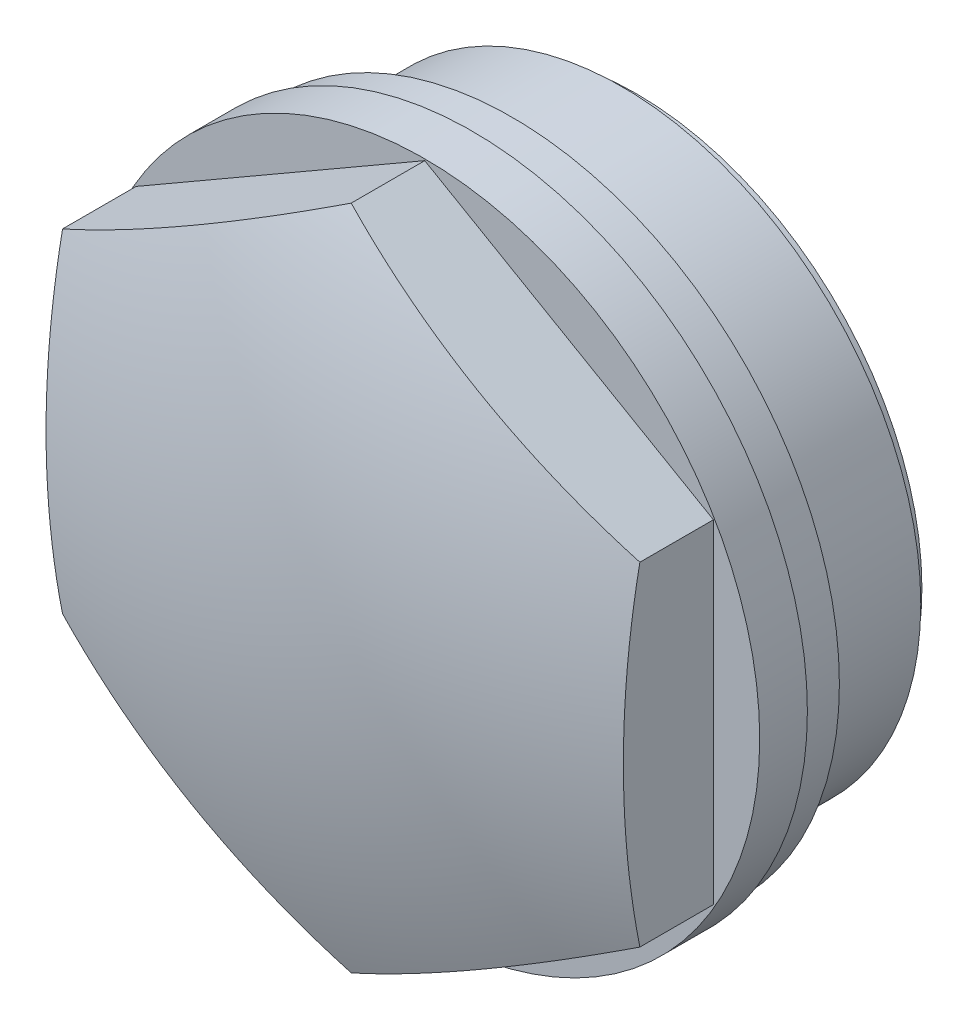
ISO-10303-21;
HEADER;
FILE_DESCRIPTION(('STEP AP214'),'2;1');
FILE_NAME('part.step','',(''),(''),'','','');
FILE_SCHEMA(('AUTOMOTIVE_DESIGN { 1 0 10303 214 1 1 1 1 }'));
ENDSEC;
DATA;
#1=APPLICATION_CONTEXT('core data for automotive mechanical design processes');
#2=APPLICATION_PROTOCOL_DEFINITION('international standard','automotive_design',2000,#1);
#3=PRODUCT_CONTEXT('',#1,'mechanical');
#4=PRODUCT('Part','Part','',(#3));
#5=PRODUCT_RELATED_PRODUCT_CATEGORY('part','',(#4));
#6=PRODUCT_DEFINITION_FORMATION('','',#4);
#7=PRODUCT_DEFINITION_CONTEXT('part definition',#1,'design');
#8=PRODUCT_DEFINITION('design','',#6,#7);
#9=PRODUCT_DEFINITION_SHAPE('','',#8);
#10=(LENGTH_UNIT() NAMED_UNIT(*) SI_UNIT(.MILLI.,.METRE.));
#11=(NAMED_UNIT(*) PLANE_ANGLE_UNIT() SI_UNIT($,.RADIAN.));
#12=(NAMED_UNIT(*) SI_UNIT($,.STERADIAN.) SOLID_ANGLE_UNIT());
#13=UNCERTAINTY_MEASURE_WITH_UNIT(LENGTH_MEASURE(1.E-05),#10,'distance_accuracy_value','');
#14=(GEOMETRIC_REPRESENTATION_CONTEXT(3) GLOBAL_UNCERTAINTY_ASSIGNED_CONTEXT((#13)) GLOBAL_UNIT_ASSIGNED_CONTEXT((#10,
#11,#12)) REPRESENTATION_CONTEXT('',''));
#15=CARTESIAN_POINT('',(0.,0.,0.));
#16=DIRECTION('',(0.,0.,1.));
#17=DIRECTION('',(1.,0.,0.));
#18=AXIS2_PLACEMENT_3D('',#15,#16,#17);
#19=CARTESIAN_POINT('',(0.,0.,15.786));
#20=DIRECTION('',(0.,0.,1.));
#21=DIRECTION('',(1.,0.,0.));
#22=AXIS2_PLACEMENT_3D('',#19,#20,#21);
#23=CYLINDRICAL_SURFACE('',#22,23.5);
#24=CARTESIAN_POINT('',(0.,0.,6.12962139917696));
#25=DIRECTION('',(0.,0.,1.));
#26=DIRECTION('',(1.,0.,0.));
#27=AXIS2_PLACEMENT_3D('',#24,#25,#26);
#28=CIRCLE('',#27,23.5);
#29=CARTESIAN_POINT('',(23.4999999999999,0.,6.12962139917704));
#30=VERTEX_POINT('',#29);
#31=EDGE_CURVE('E141',#30,#30,#28,.T.);
#32=ORIENTED_EDGE('',*,*,#31,.F.);
#33=EDGE_LOOP('',(#32));
#34=FACE_BOUND('',#33,.T.);
#35=CARTESIAN_POINT('',(0.,0.,2.786));
#36=DIRECTION('',(0.,0.,1.));
#37=DIRECTION('',(1.,0.,0.));
#38=AXIS2_PLACEMENT_3D('',#35,#36,#37);
#39=CIRCLE('',#38,23.5);
#40=CARTESIAN_POINT('',(23.5,0.,2.78600000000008));
#41=VERTEX_POINT('',#40);
#42=EDGE_CURVE('E109',#41,#41,#39,.T.);
#43=ORIENTED_EDGE('',*,*,#42,.T.);
#44=EDGE_LOOP('',(#43));
#45=FACE_BOUND('',#44,.T.);
#46=ADVANCED_FACE('F14',(#34,#45),#23,.T.);
#47=CARTESIAN_POINT('',(1.45863615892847E-13,0.,-50.4909999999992));
#48=DIRECTION('',(0.,0.,1.));
#49=DIRECTION('',(0.,-1.,0.));
#50=AXIS2_PLACEMENT_3D('',#47,#48,#49);
#51=SPHERICAL_SURFACE('',#50,63.0269999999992);
#52=CARTESIAN_POINT('',(0.,0.,10.6500879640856));
#53=DIRECTION('',(0.,0.,1.));
#54=DIRECTION('',(1.,0.,0.));
#55=AXIS2_PLACEMENT_3D('',#52,#53,#54);
#56=CIRCLE('',#55,15.3026171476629);
#57=CARTESIAN_POINT('',(15.3026171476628,0.,10.6500879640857));
#58=VERTEX_POINT('',#57);
#59=EDGE_CURVE('E133',#58,#58,#56,.T.);
#60=ORIENTED_EDGE('',*,*,#59,.F.);
#61=EDGE_LOOP('',(#60));
#62=FACE_BOUND('',#61,.T.);
#63=ADVANCED_FACE('F16',(#62),#51,.F.);
#64=CARTESIAN_POINT('',(0.,0.,10.6500879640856));
#65=DIRECTION('',(0.,0.,-1.));
#66=DIRECTION('',(-1.,0.,0.));
#67=AXIS2_PLACEMENT_3D('',#64,#65,#66);
#68=CONICAL_SURFACE('',#67,15.3026171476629,0.034906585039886);
#69=CARTESIAN_POINT('',(0.,0.,-8.714));
#70=DIRECTION('',(0.,0.,1.));
#71=DIRECTION('',(1.,0.,0.));
#72=AXIS2_PLACEMENT_3D('',#69,#70,#71);
#73=CIRCLE('',#72,15.9788259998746);
#74=CARTESIAN_POINT('',(15.9788259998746,0.,-8.71399999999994));
#75=VERTEX_POINT('',#74);
#76=EDGE_CURVE('E130',#75,#75,#73,.T.);
#77=ORIENTED_EDGE('',*,*,#76,.F.);
#78=EDGE_LOOP('',(#77));
#79=FACE_BOUND('',#78,.T.);
#80=ORIENTED_EDGE('',*,*,#59,.T.);
#81=EDGE_LOOP('',(#80));
#82=FACE_BOUND('',#81,.T.);
#83=ADVANCED_FACE('F172',(#79,#82),#68,.F.);
#84=CARTESIAN_POINT('',(0.,15.9788259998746,-8.714));
#85=DIRECTION('',(0.,0.,1.));
#86=DIRECTION('',(1.,0.,0.));
#87=AXIS2_PLACEMENT_3D('',#84,#85,#86);
#88=PLANE('',#87);
#89=CARTESIAN_POINT('',(0.,0.,-8.714));
#90=DIRECTION('',(0.,0.,1.));
#91=DIRECTION('',(1.,0.,0.));
#92=AXIS2_PLACEMENT_3D('',#89,#90,#91);
#93=CIRCLE('',#92,20.0348475);
#94=CARTESIAN_POINT('',(20.0348475,0.,-8.71399999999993));
#95=VERTEX_POINT('',#94);
#96=EDGE_CURVE('E127',#95,#95,#93,.T.);
#97=ORIENTED_EDGE('',*,*,#96,.F.);
#98=EDGE_LOOP('',(#97));
#99=FACE_BOUND('',#98,.T.);
#100=ORIENTED_EDGE('',*,*,#76,.T.);
#101=EDGE_LOOP('',(#100));
#102=FACE_BOUND('',#101,.T.);
#103=ADVANCED_FACE('F202',(#99,#102),#88,.F.);
#104=CARTESIAN_POINT('',(0.,0.,15.786));
#105=DIRECTION('',(0.,0.,1.));
#106=DIRECTION('',(1.,0.,0.));
#107=AXIS2_PLACEMENT_3D('',#104,#105,#106);
#108=CYLINDRICAL_SURFACE('',#107,20.0348475);
#109=CARTESIAN_POINT('',(0.,0.,-7.714));
#110=DIRECTION('',(0.,0.,1.));
#111=DIRECTION('',(1.,0.,0.));
#112=AXIS2_PLACEMENT_3D('',#109,#110,#111);
#113=CIRCLE('',#112,20.0348475);
#114=CARTESIAN_POINT('',(20.0348475,0.,-7.71399999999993));
#115=VERTEX_POINT('',#114);
#116=EDGE_CURVE('E124',#115,#115,#113,.T.);
#117=ORIENTED_EDGE('',*,*,#116,.F.);
#118=EDGE_LOOP('',(#117));
#119=FACE_BOUND('',#118,.T.);
#120=ORIENTED_EDGE('',*,*,#96,.T.);
#121=EDGE_LOOP('',(#120));
#122=FACE_BOUND('',#121,.T.);
#123=ADVANCED_FACE('F198',(#119,#122),#108,.T.);
#124=CARTESIAN_POINT('',(0.,20.0348475,-7.714));
#125=DIRECTION('',(0.,0.,1.));
#126=DIRECTION('',(1.,0.,0.));
#127=AXIS2_PLACEMENT_3D('',#124,#125,#126);
#128=PLANE('',#127);
#129=CARTESIAN_POINT('',(0.,0.,-7.714));
#130=DIRECTION('',(0.,0.,1.));
#131=DIRECTION('',(1.,0.,0.));
#132=AXIS2_PLACEMENT_3D('',#129,#130,#131);
#133=CIRCLE('',#132,20.955);
#134=CARTESIAN_POINT('',(20.955,0.,-7.71399999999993));
#135=VERTEX_POINT('',#134);
#136=EDGE_CURVE('E121',#135,#135,#133,.T.);
#137=ORIENTED_EDGE('',*,*,#136,.F.);
#138=EDGE_LOOP('',(#137));
#139=FACE_BOUND('',#138,.T.);
#140=ORIENTED_EDGE('',*,*,#116,.T.);
#141=EDGE_LOOP('',(#140));
#142=FACE_BOUND('',#141,.T.);
#143=ADVANCED_FACE('F194',(#139,#142),#128,.F.);
#144=CARTESIAN_POINT('',(0.,0.,15.786));
#145=DIRECTION('',(0.,0.,1.));
#146=DIRECTION('',(1.,0.,0.));
#147=AXIS2_PLACEMENT_3D('',#144,#145,#146);
#148=CYLINDRICAL_SURFACE('',#147,20.955);
#149=CARTESIAN_POINT('',(0.,0.,-0.000112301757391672));
#150=DIRECTION('',(0.,0.,1.));
#151=DIRECTION('',(1.,0.,0.));
#152=AXIS2_PLACEMENT_3D('',#149,#150,#151);
#153=CIRCLE('',#152,20.955);
#154=CARTESIAN_POINT('',(20.955,0.,-0.000112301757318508));
#155=VERTEX_POINT('',#154);
#156=EDGE_CURVE('E118',#155,#155,#153,.T.);
#157=ORIENTED_EDGE('',*,*,#156,.F.);
#158=EDGE_LOOP('',(#157));
#159=FACE_BOUND('',#158,.T.);
#160=ORIENTED_EDGE('',*,*,#136,.T.);
#161=EDGE_LOOP('',(#160));
#162=FACE_BOUND('',#161,.T.);
#163=ADVANCED_FACE('F190',(#159,#162),#148,.T.);
#164=CARTESIAN_POINT('',(0.,20.955,-0.000112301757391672));
#165=DIRECTION('',(0.,0.,1.));
#166=DIRECTION('',(1.,0.,0.));
#167=AXIS2_PLACEMENT_3D('',#164,#165,#166);
#168=PLANE('',#167);
#169=CARTESIAN_POINT('',(0.,0.,-0.000112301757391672));
#170=DIRECTION('',(0.,0.,1.));
#171=DIRECTION('',(1.,0.,0.));
#172=AXIS2_PLACEMENT_3D('',#169,#170,#171);
#173=CIRCLE('',#172,22.9595);
#174=CARTESIAN_POINT('',(22.9595,0.,-0.00011230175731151));
#175=VERTEX_POINT('',#174);
#176=EDGE_CURVE('E115',#175,#175,#173,.T.);
#177=ORIENTED_EDGE('',*,*,#176,.F.);
#178=EDGE_LOOP('',(#177));
#179=FACE_BOUND('',#178,.T.);
#180=ORIENTED_EDGE('',*,*,#156,.T.);
#181=EDGE_LOOP('',(#180));
#182=FACE_BOUND('',#181,.T.);
#183=ADVANCED_FACE('F186',(#179,#182),#168,.F.);
#184=CARTESIAN_POINT('',(0.,0.,15.786));
#185=DIRECTION('',(0.,0.,1.));
#186=DIRECTION('',(1.,0.,0.));
#187=AXIS2_PLACEMENT_3D('',#184,#185,#186);
#188=CYLINDRICAL_SURFACE('',#187,22.9595);
#189=CARTESIAN_POINT('',(0.,0.,2.786));
#190=DIRECTION('',(0.,0.,1.));
#191=DIRECTION('',(1.,0.,0.));
#192=AXIS2_PLACEMENT_3D('',#189,#190,#191);
#193=CIRCLE('',#192,22.9595);
#194=CARTESIAN_POINT('',(22.9595,0.,2.78600000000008));
#195=VERTEX_POINT('',#194);
#196=EDGE_CURVE('E112',#195,#195,#193,.T.);
#197=ORIENTED_EDGE('',*,*,#196,.F.);
#198=EDGE_LOOP('',(#197));
#199=FACE_BOUND('',#198,.T.);
#200=ORIENTED_EDGE('',*,*,#176,.T.);
#201=EDGE_LOOP('',(#200));
#202=FACE_BOUND('',#201,.T.);
#203=ADVANCED_FACE('F182',(#199,#202),#188,.T.);
#204=CARTESIAN_POINT('',(0.,22.9595,2.786));
#205=DIRECTION('',(0.,0.,1.));
#206=DIRECTION('',(1.,0.,0.));
#207=AXIS2_PLACEMENT_3D('',#204,#205,#206);
#208=PLANE('',#207);
#209=ORIENTED_EDGE('',*,*,#42,.F.);
#210=EDGE_LOOP('',(#209));
#211=FACE_BOUND('',#210,.T.);
#212=ORIENTED_EDGE('',*,*,#196,.T.);
#213=EDGE_LOOP('',(#212));
#214=FACE_BOUND('',#213,.T.);
#215=ADVANCED_FACE('F179',(#211,#214),#208,.F.);
#216=CARTESIAN_POINT('',(1.34516301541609E-13,0.,-47.241));
#217=DIRECTION('',(0.,0.,1.));
#218=DIRECTION('',(0.,1.,0.));
#219=AXIS2_PLACEMENT_3D('',#216,#217,#218);
#220=SPHERICAL_SURFACE('',#219,63.027);
#221=CARTESIAN_POINT('',(10.1250000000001,17.5370144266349,-47.241));
#222=DIRECTION('',(-0.5,-0.866025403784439,0.));
#223=DIRECTION('',(0.866025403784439,-0.5,0.));
#224=AXIS2_PLACEMENT_3D('',#221,#222,#223);
#225=CIRCLE('',#224,59.6853435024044);
#226=CARTESIAN_POINT('',(0.,23.3826859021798,11.2880759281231));
#227=VERTEX_POINT('',#226);
#228=CARTESIAN_POINT('',(20.25,11.6913429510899,11.2880759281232));
#229=VERTEX_POINT('',#228);
#230=EDGE_CURVE('E85',#227,#229,#225,.F.);
#231=ORIENTED_EDGE('',*,*,#230,.F.);
#232=CARTESIAN_POINT('',(-10.1249999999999,17.5370144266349,-47.241));
#233=DIRECTION('',(0.5,-0.866025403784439,0.));
#234=DIRECTION('',(0.866025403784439,0.5,0.));
#235=AXIS2_PLACEMENT_3D('',#232,#233,#234);
#236=CIRCLE('',#235,59.6853435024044);
#237=CARTESIAN_POINT('',(-20.25,11.6913429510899,11.288075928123));
#238=VERTEX_POINT('',#237);
#239=EDGE_CURVE('E136',#238,#227,#236,.F.);
#240=ORIENTED_EDGE('',*,*,#239,.F.);
#241=CARTESIAN_POINT('',(-20.25,0.,-47.241));
#242=DIRECTION('',(1.,0.,0.));
#243=DIRECTION('',(0.,0.,-1.));
#244=AXIS2_PLACEMENT_3D('',#241,#242,#243);
#245=CIRCLE('',#244,59.6853435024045);
#246=CARTESIAN_POINT('',(-20.25,-11.6913429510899,11.2880759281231));
#247=VERTEX_POINT('',#246);
#248=EDGE_CURVE('E36',#247,#238,#245,.F.);
#249=ORIENTED_EDGE('',*,*,#248,.F.);
#250=CARTESIAN_POINT('',(-10.1249999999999,-17.5370144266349,-47.241));
#251=DIRECTION('',(0.5,0.866025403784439,0.));
#252=DIRECTION('',(-0.866025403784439,0.5,0.));
#253=AXIS2_PLACEMENT_3D('',#250,#251,#252);
#254=CIRCLE('',#253,59.6853435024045);
#255=CARTESIAN_POINT('',(0.,-23.3826859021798,11.2880759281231));
#256=VERTEX_POINT('',#255);
#257=EDGE_CURVE('E29',#256,#247,#254,.F.);
#258=ORIENTED_EDGE('',*,*,#257,.F.);
#259=CARTESIAN_POINT('',(10.1250000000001,-17.5370144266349,-47.241));
#260=DIRECTION('',(-0.5,0.866025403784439,0.));
#261=DIRECTION('',(-0.866025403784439,-0.5,0.));
#262=AXIS2_PLACEMENT_3D('',#259,#260,#261);
#263=CIRCLE('',#262,59.6853435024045);
#264=CARTESIAN_POINT('',(20.25,-11.6913429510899,11.2880759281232));
#265=VERTEX_POINT('',#264);
#266=EDGE_CURVE('E98',#265,#256,#263,.F.);
#267=ORIENTED_EDGE('',*,*,#266,.F.);
#268=CARTESIAN_POINT('',(20.25,0.,-47.241));
#269=DIRECTION('',(-1.,0.,0.));
#270=DIRECTION('',(0.,0.,1.));
#271=AXIS2_PLACEMENT_3D('',#268,#269,#270);
#272=CIRCLE('',#271,59.6853435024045);
#273=EDGE_CURVE('E9',#229,#265,#272,.F.);
#274=ORIENTED_EDGE('',*,*,#273,.F.);
#275=EDGE_LOOP('',(#231,#240,#249,#258,#267,#274));
#276=FACE_BOUND('',#275,.T.);
#277=ADVANCED_FACE('F150',(#276),#220,.T.);
#278=CARTESIAN_POINT('',(0.,0.,6.12962139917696));
#279=DIRECTION('',(0.,0.,1.));
#280=DIRECTION('',(1.,0.,0.));
#281=AXIS2_PLACEMENT_3D('',#278,#279,#280);
#282=PLANE('',#281);
#283=ORIENTED_EDGE('',*,*,#31,.T.);
#284=EDGE_LOOP('',(#283));
#285=FACE_BOUND('',#284,.T.);
#286=DIRECTION('',(0.866025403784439,0.5,0.));
#287=VECTOR('',#286,1.);
#288=CARTESIAN_POINT('',(-20.25,11.6913429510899,6.12962139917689));
#289=LINE('',#288,#287);
#290=CARTESIAN_POINT('',(-20.25,11.6913429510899,6.12962139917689));
#291=VERTEX_POINT('',#290);
#292=CARTESIAN_POINT('',(0.,23.3826859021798,6.12962139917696));
#293=VERTEX_POINT('',#292);
#294=EDGE_CURVE('E77',#291,#293,#289,.T.);
#295=ORIENTED_EDGE('',*,*,#294,.T.);
#296=DIRECTION('',(0.866025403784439,-0.5,0.));
#297=VECTOR('',#296,1.);
#298=CARTESIAN_POINT('',(-0.100000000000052,23.4404209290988,6.12962139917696));
#299=LINE('',#298,#297);
#300=CARTESIAN_POINT('',(20.25,11.6913429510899,6.12962139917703));
#301=VERTEX_POINT('',#300);
#302=EDGE_CURVE('E68',#293,#301,#299,.T.);
#303=ORIENTED_EDGE('',*,*,#302,.T.);
#304=DIRECTION('',(0.,-1.,0.));
#305=VECTOR('',#304,1.);
#306=CARTESIAN_POINT('',(20.25,11.6913429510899,6.12962139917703));
#307=LINE('',#306,#305);
#308=CARTESIAN_POINT('',(20.25,-11.6913429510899,6.12962139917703));
#309=VERTEX_POINT('',#308);
#310=EDGE_CURVE('E73',#301,#309,#307,.T.);
#311=ORIENTED_EDGE('',*,*,#310,.T.);
#312=DIRECTION('',(-0.866025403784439,-0.5,0.));
#313=VECTOR('',#312,1.);
#314=CARTESIAN_POINT('',(20.25,-11.6913429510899,6.12962139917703));
#315=LINE('',#314,#313);
#316=CARTESIAN_POINT('',(0.,-23.3826859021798,6.12962139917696));
#317=VERTEX_POINT('',#316);
#318=EDGE_CURVE('E92',#309,#317,#315,.T.);
#319=ORIENTED_EDGE('',*,*,#318,.T.);
#320=DIRECTION('',(-0.866025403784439,0.5,0.));
#321=VECTOR('',#320,1.);
#322=CARTESIAN_POINT('',(0.0999999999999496,-23.4404209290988,6.12962139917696));
#323=LINE('',#322,#321);
#324=CARTESIAN_POINT('',(-20.25,-11.6913429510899,6.12962139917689));
#325=VERTEX_POINT('',#324);
#326=EDGE_CURVE('E100',#317,#325,#323,.T.);
#327=ORIENTED_EDGE('',*,*,#326,.T.);
#328=DIRECTION('',(0.,1.,0.));
#329=VECTOR('',#328,1.);
#330=CARTESIAN_POINT('',(-20.25,-11.6913429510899,6.12962139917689));
#331=LINE('',#330,#329);
#332=EDGE_CURVE('E102',#325,#291,#331,.T.);
#333=ORIENTED_EDGE('',*,*,#332,.T.);
#334=EDGE_LOOP('',(#295,#303,#311,#319,#327,#333));
#335=FACE_BOUND('',#334,.T.);
#336=ADVANCED_FACE('F70',(#285,#335),#282,.T.);
#337=CARTESIAN_POINT('',(0.0999999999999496,-23.4404209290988,6.12962139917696));
#338=DIRECTION('',(0.5,0.866025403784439,0.));
#339=DIRECTION('',(-0.866025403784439,0.5,0.));
#340=AXIS2_PLACEMENT_3D('',#337,#338,#339);
#341=PLANE('',#340);
#342=ORIENTED_EDGE('',*,*,#326,.F.);
#343=DIRECTION('',(0.,0.,1.));
#344=VECTOR('',#343,1.);
#345=CARTESIAN_POINT('',(0.,-23.3826859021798,6.12962139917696));
#346=LINE('',#345,#344);
#347=EDGE_CURVE('E22',#317,#256,#346,.T.);
#348=ORIENTED_EDGE('',*,*,#347,.T.);
#349=ORIENTED_EDGE('',*,*,#257,.T.);
#350=DIRECTION('',(0.,0.,1.));
#351=VECTOR('',#350,1.);
#352=CARTESIAN_POINT('',(-20.25,-11.6913429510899,6.12962139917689));
#353=LINE('',#352,#351);
#354=EDGE_CURVE('E107',#325,#247,#353,.T.);
#355=ORIENTED_EDGE('',*,*,#354,.F.);
#356=EDGE_LOOP('',(#342,#348,#349,#355));
#357=FACE_BOUND('',#356,.T.);
#358=ADVANCED_FACE('F146',(#357),#341,.F.);
#359=CARTESIAN_POINT('',(-20.25,-11.6913429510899,6.12962139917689));
#360=DIRECTION('',(1.,0.,0.));
#361=DIRECTION('',(0.,0.,-1.));
#362=AXIS2_PLACEMENT_3D('',#359,#360,#361);
#363=PLANE('',#362);
#364=ORIENTED_EDGE('',*,*,#248,.T.);
#365=DIRECTION('',(0.,0.,1.));
#366=VECTOR('',#365,1.);
#367=CARTESIAN_POINT('',(-20.25,11.6913429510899,6.12962139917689));
#368=LINE('',#367,#366);
#369=EDGE_CURVE('E105',#291,#238,#368,.T.);
#370=ORIENTED_EDGE('',*,*,#369,.F.);
#371=ORIENTED_EDGE('',*,*,#332,.F.);
#372=ORIENTED_EDGE('',*,*,#354,.T.);
#373=EDGE_LOOP('',(#364,#370,#371,#372));
#374=FACE_BOUND('',#373,.T.);
#375=ADVANCED_FACE('F155',(#374),#363,.F.);
#376=CARTESIAN_POINT('',(-20.25,11.6913429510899,6.12962139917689));
#377=DIRECTION('',(0.5,-0.866025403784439,0.));
#378=DIRECTION('',(0.866025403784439,0.5,0.));
#379=AXIS2_PLACEMENT_3D('',#376,#377,#378);
#380=PLANE('',#379);
#381=ORIENTED_EDGE('',*,*,#239,.T.);
#382=DIRECTION('',(0.,0.,-1.));
#383=VECTOR('',#382,1.);
#384=CARTESIAN_POINT('',(0.,23.3826859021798,6.12962139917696));
#385=LINE('',#384,#383);
#386=EDGE_CURVE('E144',#227,#293,#385,.T.);
#387=ORIENTED_EDGE('',*,*,#386,.T.);
#388=ORIENTED_EDGE('',*,*,#294,.F.);
#389=ORIENTED_EDGE('',*,*,#369,.T.);
#390=EDGE_LOOP('',(#381,#387,#388,#389));
#391=FACE_BOUND('',#390,.T.);
#392=ADVANCED_FACE('F153',(#391),#380,.F.);
#393=CARTESIAN_POINT('',(-0.100000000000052,23.4404209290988,6.12962139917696));
#394=DIRECTION('',(-0.5,-0.866025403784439,0.));
#395=DIRECTION('',(0.866025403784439,-0.5,0.));
#396=AXIS2_PLACEMENT_3D('',#393,#394,#395);
#397=PLANE('',#396);
#398=ORIENTED_EDGE('',*,*,#230,.T.);
#399=DIRECTION('',(0.,0.,1.));
#400=VECTOR('',#399,1.);
#401=CARTESIAN_POINT('',(20.25,11.6913429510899,6.12962139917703));
#402=LINE('',#401,#400);
#403=EDGE_CURVE('E82',#301,#229,#402,.T.);
#404=ORIENTED_EDGE('',*,*,#403,.F.);
#405=ORIENTED_EDGE('',*,*,#302,.F.);
#406=ORIENTED_EDGE('',*,*,#386,.F.);
#407=EDGE_LOOP('',(#398,#404,#405,#406));
#408=FACE_BOUND('',#407,.T.);
#409=ADVANCED_FACE('F83',(#408),#397,.F.);
#410=CARTESIAN_POINT('',(20.25,11.6913429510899,6.12962139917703));
#411=DIRECTION('',(-1.,0.,0.));
#412=DIRECTION('',(0.,0.,1.));
#413=AXIS2_PLACEMENT_3D('',#410,#411,#412);
#414=PLANE('',#413);
#415=ORIENTED_EDGE('',*,*,#273,.T.);
#416=DIRECTION('',(0.,0.,1.));
#417=VECTOR('',#416,1.);
#418=CARTESIAN_POINT('',(20.25,-11.6913429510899,6.12962139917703));
#419=LINE('',#418,#417);
#420=EDGE_CURVE('E88',#309,#265,#419,.T.);
#421=ORIENTED_EDGE('',*,*,#420,.F.);
#422=ORIENTED_EDGE('',*,*,#310,.F.);
#423=ORIENTED_EDGE('',*,*,#403,.T.);
#424=EDGE_LOOP('',(#415,#421,#422,#423));
#425=FACE_BOUND('',#424,.T.);
#426=ADVANCED_FACE('F90',(#425),#414,.F.);
#427=CARTESIAN_POINT('',(20.25,-11.6913429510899,6.12962139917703));
#428=DIRECTION('',(-0.5,0.866025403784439,0.));
#429=DIRECTION('',(-0.866025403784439,-0.5,0.));
#430=AXIS2_PLACEMENT_3D('',#427,#428,#429);
#431=PLANE('',#430);
#432=ORIENTED_EDGE('',*,*,#266,.T.);
#433=ORIENTED_EDGE('',*,*,#347,.F.);
#434=ORIENTED_EDGE('',*,*,#318,.F.);
#435=ORIENTED_EDGE('',*,*,#420,.T.);
#436=EDGE_LOOP('',(#432,#433,#434,#435));
#437=FACE_BOUND('',#436,.T.);
#438=ADVANCED_FACE('F156',(#437),#431,.F.);
#439=CLOSED_SHELL('',(#46,#63,#83,#103,#123,#143,#163,#183,#203,#215,#277,#336,#358,#375,#392,
#409,#426,#438));
#440=MANIFOLD_SOLID_BREP('B1',#439);
#441=ADVANCED_BREP_SHAPE_REPRESENTATION('',(#18,#440),#14);
#442=SHAPE_DEFINITION_REPRESENTATION(#9,#441);
ENDSEC;
END-ISO-10303-21;
